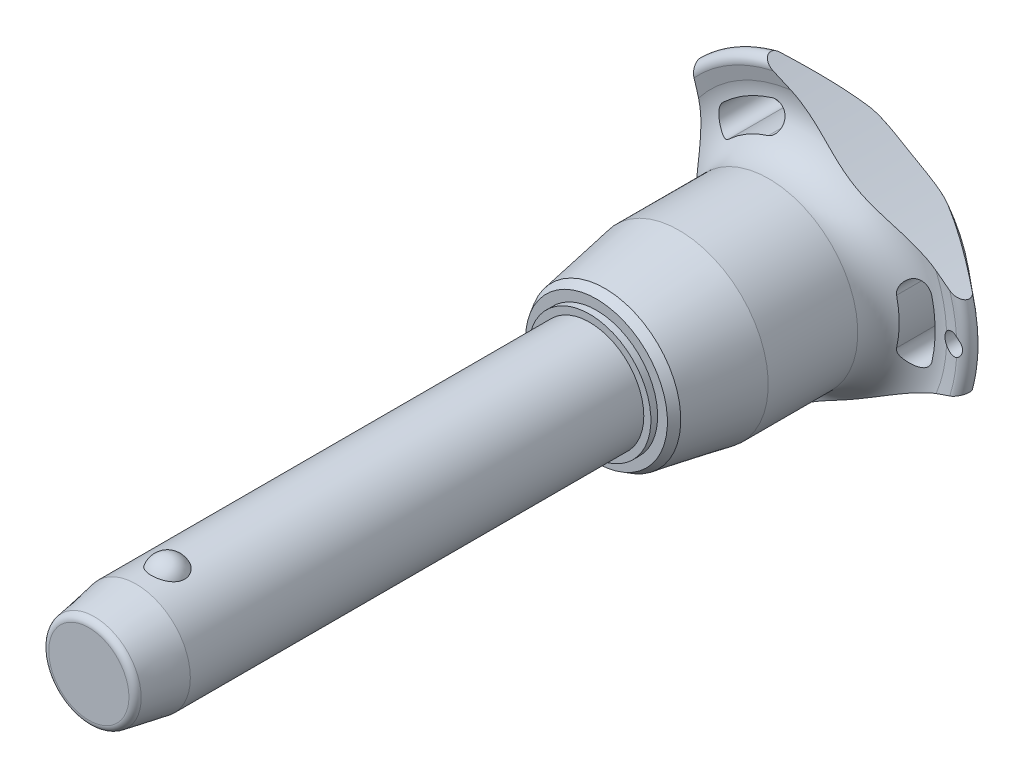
from build123d import *

# Parameters (mm, degrees)
SKETCH1_R           = 8
BOSS_EXTRUDE1_DEPTH = 60
SKETCH2_R           = 7
BOSS_EXTRUDE2_DEPTH = 39.7
BOSS_EXTRUDE3_START = 14
SKETCH1_2_R         = 8
BOSS_EXTRUDE3_DEPTH = 14
CHAMFER1_SIZE       = 7
CHAMFER1_SIZE2      = 1.234288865
FILLET1_R           = 1
SKETCH6_R           = 144.275
CUT_EXTRUDE1_DEPTH  = 106.231005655
CIRPATTERN1_COUNT   = 3
SKETCH7_R           = 1.5
CUT_EXTRUDE2_DEPTH  = 106.040118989


with BuildPart() as part:
    # Sketch1 → Boss-Extrude1 (new body)
    with BuildSketch(Plane.XY):
        Circle(SKETCH1_R)
    extrude(amount=-BOSS_EXTRUDE1_DEPTH)

    # Sketch2 → Boss-Extrude2 (add)
    with BuildSketch(Plane(origin=(0, 0, -60), x_dir=(-1, 0, 0), z_dir=(0, 0, -1))):
        Circle(SKETCH2_R)
    extrude(amount=BOSS_EXTRUDE2_DEPTH)

    # Sketch3 → Revolve1 (revolve)
    with BuildSketch(Plane(origin=(0, 0, 0), x_dir=(0, 0, -1), z_dir=(1, 0, 0))):
        with BuildLine():
            Line((-2.387467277, 9.5), (-2.387467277, 4.2))
            ThreePointArc((-2.387467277, 4.2), (0.262532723, 6.85), (-2.387467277, 9.5))
        make_face()
        with BuildLine():
            Line((-2.387467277, -4.2), (-2.387467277, -9.5))
            ThreePointArc((-2.387467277, -9.5), (0.262532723, -6.85), (-2.387467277, -4.2))
        make_face()
    revolve(axis=Axis((0, -4.2, 2.387467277), (0, 1, 0)))

    # Sketch1_2 → Boss-Extrude3 (add)
    with BuildSketch(Plane.XY.offset(BOSS_EXTRUDE3_START)):
        Circle(SKETCH1_2_R)
    extrude(amount=-BOSS_EXTRUDE3_DEPTH)

    # Chamfer1
    chamfer1_edges = [part.edges().sort_by_distance(p)[0] for p in [
        (-8, 0, 14),
    ]]
    chamfer1_side = [part.faces().sort_by_distance(p)[0] for p in [
        (-8, 0, -23),
    ]]
    chamfer(chamfer1_edges, length=CHAMFER1_SIZE, length2=CHAMFER1_SIZE2, reference=chamfer1_side[0])

    # Fillet1
    fillet1_edges = [part.edges().sort_by_distance(p)[0] for p in [
        (-6.765711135, 0, 14),
        (7, 0, -99.7),
    ]]
    fillet(fillet1_edges, radius=FILLET1_R)

    # Sketch4 → Revolve2 (revolve)
    with BuildSketch(Plane(origin=(0, 0, 0), x_dir=(0, 0, -1), z_dir=(1, 0, 0)), mode=Mode.PRIVATE) as revolve2_sk:
        Polygon((60, 0), (60, 9.044607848), (61, 9.044607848), (61, 10.490707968), (62.25235944, 11.213758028), (73.233333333, 13.15), (86.466666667, 13.15), (86.466666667, 0), align=None)
    revolve(revolve2_sk.sketch.rotate(Axis((0, 0, -86.466666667), (0, 0, 1)), 90), axis=Axis((0, 0, -86.466666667), (0, 0, 1)))

    # Sketch5 → Revolve3 (revolve)
    with BuildSketch(Plane(origin=(0, 0, 0), x_dir=(0, 0, -1), z_dir=(1, 0, 0)), mode=Mode.PRIVATE) as revolve3_sk:
        with BuildLine():
            Line((92.32877039, 20.428960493), (91.910912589, 22.344207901))
            ThreePointArc((91.910912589, 22.344207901), (92.554394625, 23.677136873), (94.002586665, 23.371345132))
            Line((94.002586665, 23.371345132), (99.141488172, 17.247040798))
            ThreePointArc((99.141488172, 17.247040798), (99.7, 15.584758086), (98.978803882, 13.986322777))
            ThreePointArc((98.978803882, 13.986322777), (94.617427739, 7.589034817), (93.083333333, 0))
            Line((93.083333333, 0), (86.466666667, 0))
            Line((86.466666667, 0), (86.466666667, 13.15))
            ThreePointArc((86.466666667, 13.15), (91.139661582, 15.38660811), (92.32877039, 20.428960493))
        make_face()
    revolve(revolve3_sk.sketch.rotate(Axis((0, 0, -93.083333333), (0, 0, 1)), 90), axis=Axis((0, 0, -93.083333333), (0, 0, 1)))

    # Sketch6 → Cut-Extrude1 (cut, through all)
    with BuildSketch(Plane.XY):
        with Locations((-159.975, 0)):
            Circle(SKETCH6_R)
        with BuildLine():
            ThreePointArc((18.131206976, -4.190753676), (18.60922037, 0), (18.131206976, 4.190753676))
            ThreePointArc((18.131206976, 4.190753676), (15.94840906, 5.553949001), (14.585213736, 3.371151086))
            ThreePointArc((14.585213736, 3.371151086), (14.969740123, 0), (14.585213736, -3.371151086))
            ThreePointArc((14.585213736, -3.371151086), (15.94840906, -5.553949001), (18.131206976, -4.190753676))
        make_face()
    cut_extrude1 = extrude(amount=-CUT_EXTRUDE1_DEPTH, mode=Mode.SUBTRACT)

    # CirPattern1: Cut-Extrude1 ×3 about axis
    cirpattern1_axis = Axis((0, 0, 0), (0, 0, 1))
    for i in range(1, CIRPATTERN1_COUNT):
        add(cut_extrude1.rotate(cirpattern1_axis, i * 360 / CIRPATTERN1_COUNT), mode=Mode.SUBTRACT)

    # Sketch7 → Cut-Extrude2 (cut, through all)
    with BuildSketch(Plane.XY):
        with Locations(Location((21.60922037, 0, 0), (0, 0, 297.620773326))):
            Circle(SKETCH7_R)
    extrude(amount=-CUT_EXTRUDE2_DEPTH, mode=Mode.SUBTRACT)


solid = part.part
